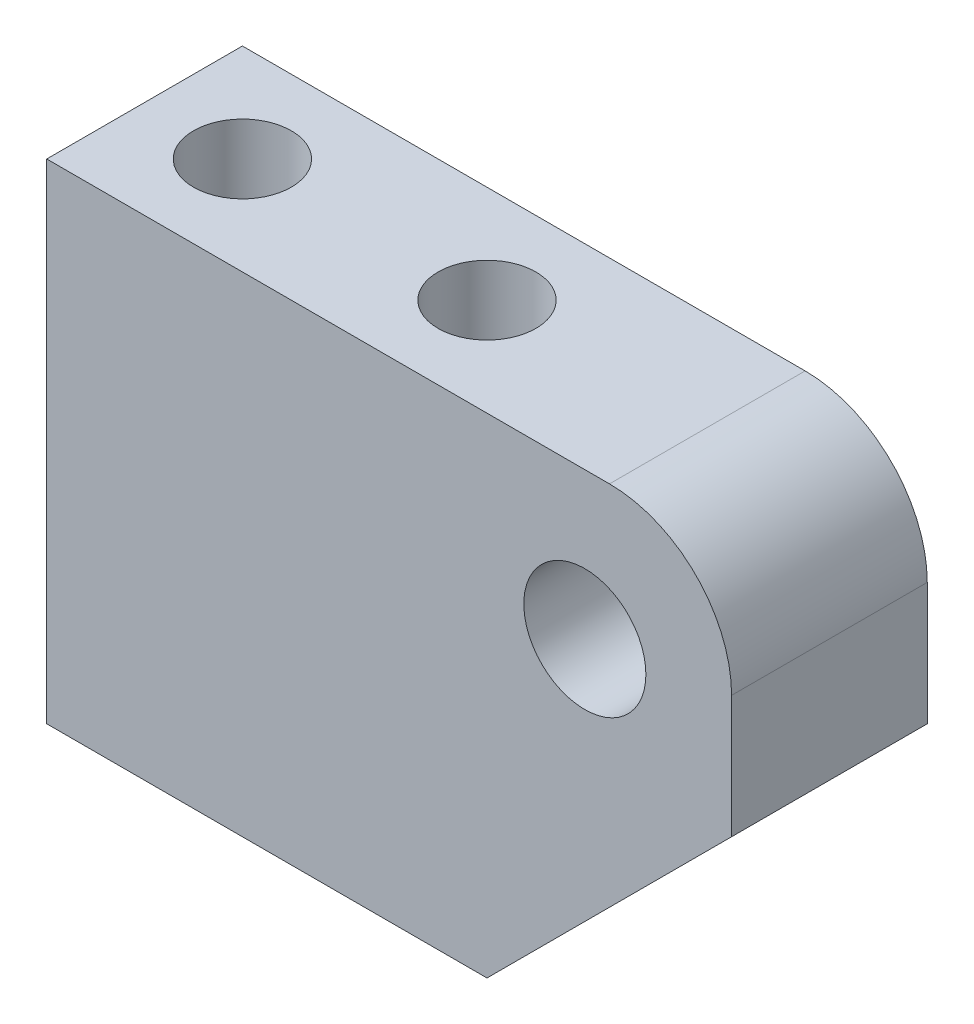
from build123d import *

# Parameters (mm, degrees)
SKETCH2_R           = 3.9624
BOSS_EXTRUDE1_DEPTH = 6.35
SKETCH3_R           = 3.175
CUT_EXTRUDE1_DEPTH  = 38.1
FILLET1_R           = 7.9248


with BuildPart() as part:
    # Sketch2 → Boss-Extrude1 (new, symmetric)
    with BuildSketch(Plane.XY):
        Polygon((-6.35, -22.225), (-34.925, -22.225), (-34.925, 9.525), (9.525, 9.525), (9.525, -6.35), align=None)
        Circle(SKETCH2_R, mode=Mode.SUBTRACT)
    extrude(amount=BOSS_EXTRUDE1_DEPTH, both=True)

    # Sketch3 → Cut-Extrude1 (cut, symmetric)
    with BuildSketch(Plane(origin=(0, 0, 0), x_dir=(1, 0, 0), z_dir=(0, 1, 0))):
        with Locations(Location((-12.7, 0, 0), (0, 0, 270))):
            Circle(SKETCH3_R)
        with Locations(Location((-28.575, 0, 0), (0, 0, 270))):
            Circle(SKETCH3_R)
    extrude(amount=CUT_EXTRUDE1_DEPTH, both=True, mode=Mode.SUBTRACT)

    # Fillet1
    fillet1_edges = [part.edges().sort_by_distance(p)[0] for p in [
        (9.525, 9.525, 0),
    ]]
    fillet(fillet1_edges, radius=FILLET1_R)


solid = part.part
